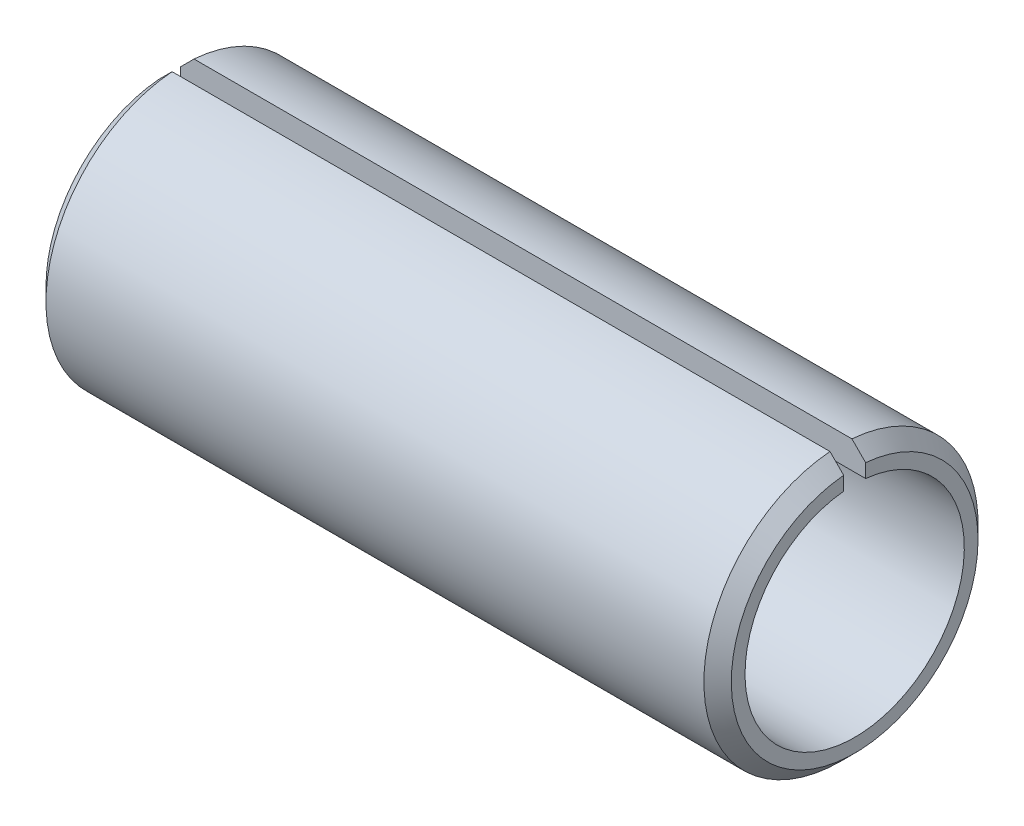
from build123d import *

# Parameters (mm, degrees)
ENL_V_MAT_EXTRU_2_DEPTH = 11.392304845


with BuildPart() as part:
    # Esquisse1 → Base-R_volution (revolve)
    with BuildSketch(Plane.XY):
        Polygon((0, 1.6), (0, 1.8), (0.2, 2), (9.8, 2), (10, 1.8), (10, 1.6), align=None)
    revolve(axis=Axis((0, 0, 0), (1, 0, 0)))

    # Esquisse2 → Enl_v. mat.-Extru.2 (cut, through all)
    with BuildSketch(Plane(origin=(0, 0, 0), x_dir=(0, 0, -1), z_dir=(1, 0, 0))):
        with BuildLine():
            Line((0.16, 1.993589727), (0.16, 1.591979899))
            ThreePointArc((0.16, 1.591979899), (0, 1.6), (-0.16, 1.591979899))
            Line((-0.16, 1.591979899), (-0.16, 1.993589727))
            ThreePointArc((-0.16, 1.993589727), (0, 2), (0.16, 1.993589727))
        make_face()
    extrude(amount=ENL_V_MAT_EXTRU_2_DEPTH, mode=Mode.SUBTRACT)


solid = part.part
